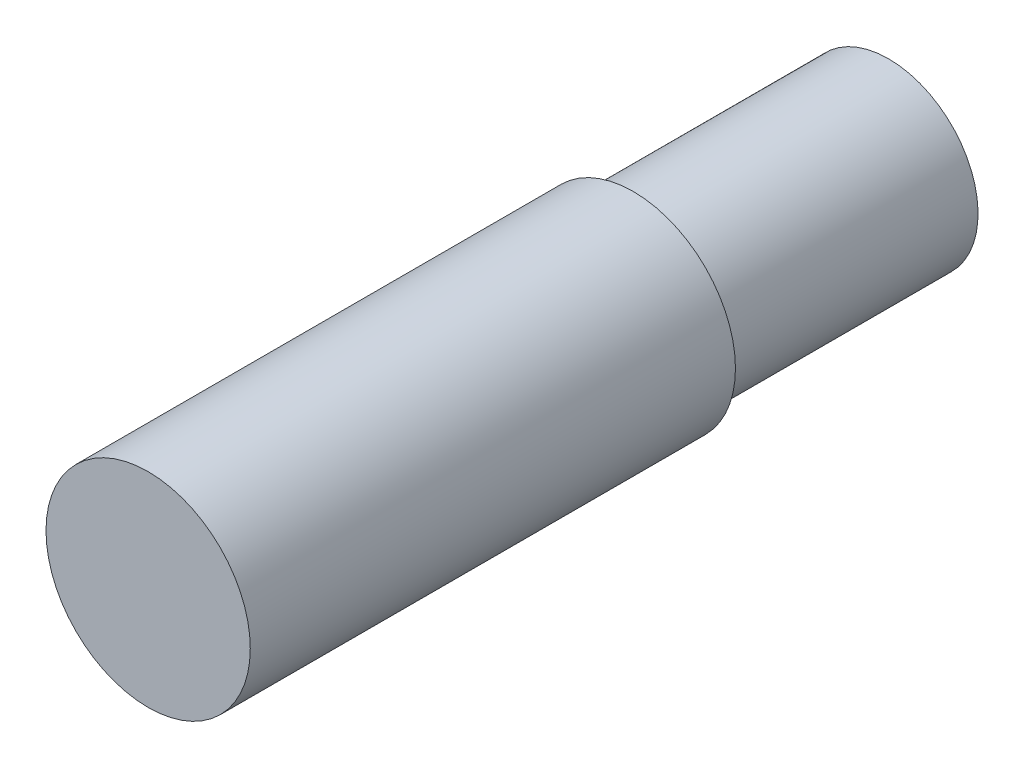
ISO-10303-21;
HEADER;
FILE_DESCRIPTION(('STEP AP214'),'2;1');
FILE_NAME('part.step','',(''),(''),'','','');
FILE_SCHEMA(('AUTOMOTIVE_DESIGN { 1 0 10303 214 1 1 1 1 }'));
ENDSEC;
DATA;
#1=APPLICATION_CONTEXT('core data for automotive mechanical design processes');
#2=APPLICATION_PROTOCOL_DEFINITION('international standard','automotive_design',2000,#1);
#3=PRODUCT_CONTEXT('',#1,'mechanical');
#4=PRODUCT('Part','Part','',(#3));
#5=PRODUCT_RELATED_PRODUCT_CATEGORY('part','',(#4));
#6=PRODUCT_DEFINITION_FORMATION('','',#4);
#7=PRODUCT_DEFINITION_CONTEXT('part definition',#1,'design');
#8=PRODUCT_DEFINITION('design','',#6,#7);
#9=PRODUCT_DEFINITION_SHAPE('','',#8);
#10=(LENGTH_UNIT() NAMED_UNIT(*) SI_UNIT(.MILLI.,.METRE.));
#11=(NAMED_UNIT(*) PLANE_ANGLE_UNIT() SI_UNIT($,.RADIAN.));
#12=(NAMED_UNIT(*) SI_UNIT($,.STERADIAN.) SOLID_ANGLE_UNIT());
#13=UNCERTAINTY_MEASURE_WITH_UNIT(LENGTH_MEASURE(1.E-05),#10,'distance_accuracy_value','');
#14=(GEOMETRIC_REPRESENTATION_CONTEXT(3) GLOBAL_UNCERTAINTY_ASSIGNED_CONTEXT((#13)) GLOBAL_UNIT_ASSIGNED_CONTEXT((#10,
#11,#12)) REPRESENTATION_CONTEXT('',''));
#15=CARTESIAN_POINT('',(0.,0.,0.));
#16=DIRECTION('',(0.,0.,1.));
#17=DIRECTION('',(1.,0.,0.));
#18=AXIS2_PLACEMENT_3D('',#15,#16,#17);
#19=CARTESIAN_POINT('',(0.,0.,0.));
#20=DIRECTION('',(0.,0.,1.));
#21=DIRECTION('',(0.,-1.,0.));
#22=AXIS2_PLACEMENT_3D('',#19,#20,#21);
#23=PLANE('',#22);
#24=CARTESIAN_POINT('',(0.,0.,0.));
#25=DIRECTION('',(0.,0.,-1.));
#26=DIRECTION('',(0.,1.,0.));
#27=AXIS2_PLACEMENT_3D('',#24,#25,#26);
#28=CIRCLE('',#27,25.4);
#29=CARTESIAN_POINT('',(0.,25.4,0.));
#30=VERTEX_POINT('',#29);
#31=EDGE_CURVE('E10',#30,#30,#28,.T.);
#32=ORIENTED_EDGE('',*,*,#31,.F.);
#33=EDGE_LOOP('',(#32));
#34=FACE_BOUND('',#33,.T.);
#35=ADVANCED_FACE('F31',(#34),#23,.T.);
#36=CARTESIAN_POINT('',(0.,0.,-184.15));
#37=DIRECTION('',(0.,0.,-1.));
#38=DIRECTION('',(0.,1.,0.));
#39=AXIS2_PLACEMENT_3D('',#36,#37,#38);
#40=CYLINDRICAL_SURFACE('',#39,25.4);
#41=ORIENTED_EDGE('',*,*,#31,.T.);
#42=EDGE_LOOP('',(#41));
#43=FACE_BOUND('',#42,.T.);
#44=CARTESIAN_POINT('',(0.,0.,-120.65));
#45=DIRECTION('',(0.,0.,-1.));
#46=DIRECTION('',(0.,1.,0.));
#47=AXIS2_PLACEMENT_3D('',#44,#45,#46);
#48=CIRCLE('',#47,25.4);
#49=CARTESIAN_POINT('',(0.,25.4,-120.65));
#50=VERTEX_POINT('',#49);
#51=EDGE_CURVE('E37',#50,#50,#48,.T.);
#52=ORIENTED_EDGE('',*,*,#51,.F.);
#53=EDGE_LOOP('',(#52));
#54=FACE_BOUND('',#53,.T.);
#55=ADVANCED_FACE('F63',(#43,#54),#40,.T.);
#56=CARTESIAN_POINT('',(0.,25.4,-120.65));
#57=DIRECTION('',(0.,0.,-1.));
#58=DIRECTION('',(0.,1.,0.));
#59=AXIS2_PLACEMENT_3D('',#56,#57,#58);
#60=PLANE('',#59);
#61=ORIENTED_EDGE('',*,*,#51,.T.);
#62=EDGE_LOOP('',(#61));
#63=FACE_BOUND('',#62,.T.);
#64=CARTESIAN_POINT('',(0.,0.,-120.65));
#65=DIRECTION('',(0.,0.,-1.));
#66=DIRECTION('',(0.,1.,0.));
#67=AXIS2_PLACEMENT_3D('',#64,#65,#66);
#68=CIRCLE('',#67,22.225);
#69=CARTESIAN_POINT('',(0.,22.225,-120.65));
#70=VERTEX_POINT('',#69);
#71=EDGE_CURVE('E41',#70,#70,#68,.T.);
#72=ORIENTED_EDGE('',*,*,#71,.F.);
#73=EDGE_LOOP('',(#72));
#74=FACE_BOUND('',#73,.T.);
#75=ADVANCED_FACE('F55',(#63,#74),#60,.T.);
#76=CARTESIAN_POINT('',(0.,0.,-184.15));
#77=DIRECTION('',(0.,0.,-1.));
#78=DIRECTION('',(0.,1.,0.));
#79=AXIS2_PLACEMENT_3D('',#76,#77,#78);
#80=CYLINDRICAL_SURFACE('',#79,22.225);
#81=ORIENTED_EDGE('',*,*,#71,.T.);
#82=EDGE_LOOP('',(#81));
#83=FACE_BOUND('',#82,.T.);
#84=CARTESIAN_POINT('',(0.,0.,-184.15));
#85=DIRECTION('',(0.,0.,-1.));
#86=DIRECTION('',(0.,1.,0.));
#87=AXIS2_PLACEMENT_3D('',#84,#85,#86);
#88=CIRCLE('',#87,22.225);
#89=CARTESIAN_POINT('',(0.,22.225,-184.15));
#90=VERTEX_POINT('',#89);
#91=EDGE_CURVE('E45',#90,#90,#88,.T.);
#92=ORIENTED_EDGE('',*,*,#91,.F.);
#93=EDGE_LOOP('',(#92));
#94=FACE_BOUND('',#93,.T.);
#95=ADVANCED_FACE('F53',(#83,#94),#80,.T.);
#96=CARTESIAN_POINT('',(0.,0.,-134.52790802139));
#97=DIRECTION('',(0.,0.,1.));
#98=DIRECTION('',(0.,1.,0.));
#99=AXIS2_PLACEMENT_3D('',#96,#97,#98);
#100=SPHERICAL_SURFACE('',#99,54.3718919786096);
#101=ORIENTED_EDGE('',*,*,#91,.T.);
#102=EDGE_LOOP('',(#101));
#103=FACE_BOUND('',#102,.T.);
#104=ADVANCED_FACE('F51',(#103),#100,.T.);
#105=CLOSED_SHELL('',(#35,#55,#75,#95,#104));
#106=MANIFOLD_SOLID_BREP('B2',#105);
#107=ADVANCED_BREP_SHAPE_REPRESENTATION('',(#18,#106),#14);
#108=SHAPE_DEFINITION_REPRESENTATION(#9,#107);
ENDSEC;
END-ISO-10303-21;
